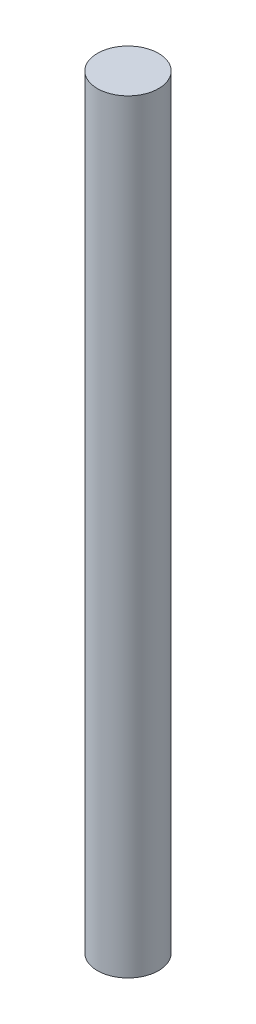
ISO-10303-21;
HEADER;
FILE_DESCRIPTION(('STEP AP214'),'2;1');
FILE_NAME('part.step','',(''),(''),'','','');
FILE_SCHEMA(('AUTOMOTIVE_DESIGN { 1 0 10303 214 1 1 1 1 }'));
ENDSEC;
DATA;
#1=APPLICATION_CONTEXT('core data for automotive mechanical design processes');
#2=APPLICATION_PROTOCOL_DEFINITION('international standard','automotive_design',2000,#1);
#3=PRODUCT_CONTEXT('',#1,'mechanical');
#4=PRODUCT('Part','Part','',(#3));
#5=PRODUCT_RELATED_PRODUCT_CATEGORY('part','',(#4));
#6=PRODUCT_DEFINITION_FORMATION('','',#4);
#7=PRODUCT_DEFINITION_CONTEXT('part definition',#1,'design');
#8=PRODUCT_DEFINITION('design','',#6,#7);
#9=PRODUCT_DEFINITION_SHAPE('','',#8);
#10=(LENGTH_UNIT() NAMED_UNIT(*) SI_UNIT(.MILLI.,.METRE.));
#11=(NAMED_UNIT(*) PLANE_ANGLE_UNIT() SI_UNIT($,.RADIAN.));
#12=(NAMED_UNIT(*) SI_UNIT($,.STERADIAN.) SOLID_ANGLE_UNIT());
#13=UNCERTAINTY_MEASURE_WITH_UNIT(LENGTH_MEASURE(1.E-05),#10,'distance_accuracy_value','');
#14=(GEOMETRIC_REPRESENTATION_CONTEXT(3) GLOBAL_UNCERTAINTY_ASSIGNED_CONTEXT((#13)) GLOBAL_UNIT_ASSIGNED_CONTEXT((#10,
#11,#12)) REPRESENTATION_CONTEXT('',''));
#15=CARTESIAN_POINT('',(0.,0.,0.));
#16=DIRECTION('',(0.,0.,1.));
#17=DIRECTION('',(1.,0.,0.));
#18=AXIS2_PLACEMENT_3D('',#15,#16,#17);
#19=CARTESIAN_POINT('',(0.,-200.,0.));
#20=DIRECTION('',(0.,1.,0.));
#21=DIRECTION('',(0.,0.,1.));
#22=AXIS2_PLACEMENT_3D('',#19,#20,#21);
#23=CYLINDRICAL_SURFACE('',#22,8.);
#24=CARTESIAN_POINT('',(0.,-200.,0.));
#25=DIRECTION('',(0.,1.,0.));
#26=DIRECTION('',(0.,0.,1.));
#27=AXIS2_PLACEMENT_3D('',#24,#25,#26);
#28=CIRCLE('',#27,8.);
#29=CARTESIAN_POINT('',(0.,-200.,8.));
#30=VERTEX_POINT('',#29);
#31=EDGE_CURVE('E10',#30,#30,#28,.T.);
#32=ORIENTED_EDGE('',*,*,#31,.T.);
#33=EDGE_LOOP('',(#32));
#34=FACE_BOUND('',#33,.T.);
#35=CARTESIAN_POINT('',(0.,0.,0.));
#36=DIRECTION('',(0.,1.,0.));
#37=DIRECTION('',(0.,0.,1.));
#38=AXIS2_PLACEMENT_3D('',#35,#36,#37);
#39=CIRCLE('',#38,8.);
#40=CARTESIAN_POINT('',(0.,0.,8.));
#41=VERTEX_POINT('',#40);
#42=EDGE_CURVE('E30',#41,#41,#39,.T.);
#43=ORIENTED_EDGE('',*,*,#42,.F.);
#44=EDGE_LOOP('',(#43));
#45=FACE_BOUND('',#44,.T.);
#46=ADVANCED_FACE('F24',(#34,#45),#23,.T.);
#47=CARTESIAN_POINT('',(0.,-200.,0.));
#48=DIRECTION('',(0.,1.,0.));
#49=DIRECTION('',(0.,0.,1.));
#50=AXIS2_PLACEMENT_3D('',#47,#48,#49);
#51=PLANE('',#50);
#52=ORIENTED_EDGE('',*,*,#31,.F.);
#53=EDGE_LOOP('',(#52));
#54=FACE_BOUND('',#53,.T.);
#55=ADVANCED_FACE('F39',(#54),#51,.F.);
#56=CARTESIAN_POINT('',(0.,0.,0.));
#57=DIRECTION('',(0.,1.,0.));
#58=DIRECTION('',(0.,0.,1.));
#59=AXIS2_PLACEMENT_3D('',#56,#57,#58);
#60=PLANE('',#59);
#61=ORIENTED_EDGE('',*,*,#42,.T.);
#62=EDGE_LOOP('',(#61));
#63=FACE_BOUND('',#62,.T.);
#64=ADVANCED_FACE('F36',(#63),#60,.T.);
#65=CLOSED_SHELL('',(#46,#55,#64));
#66=MANIFOLD_SOLID_BREP('B2',#65);
#67=ADVANCED_BREP_SHAPE_REPRESENTATION('',(#18,#66),#14);
#68=SHAPE_DEFINITION_REPRESENTATION(#9,#67);
ENDSEC;
END-ISO-10303-21;
